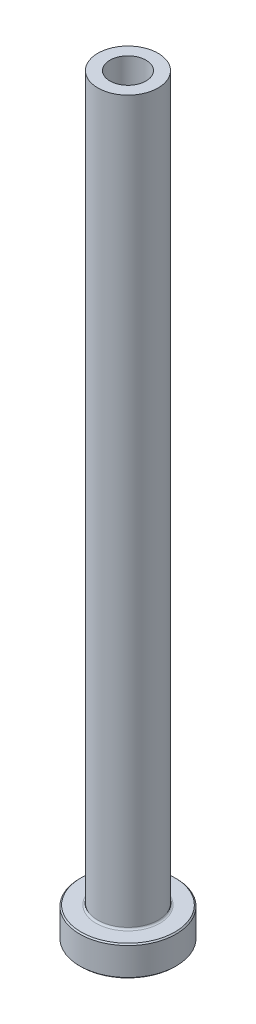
ISO-10303-21;
HEADER;
FILE_DESCRIPTION(('STEP AP214'),'2;1');
FILE_NAME('part.step','',(''),(''),'','','');
FILE_SCHEMA(('AUTOMOTIVE_DESIGN { 1 0 10303 214 1 1 1 1 }'));
ENDSEC;
DATA;
#1=APPLICATION_CONTEXT('core data for automotive mechanical design processes');
#2=APPLICATION_PROTOCOL_DEFINITION('international standard','automotive_design',2000,#1);
#3=PRODUCT_CONTEXT('',#1,'mechanical');
#4=PRODUCT('Part','Part','',(#3));
#5=PRODUCT_RELATED_PRODUCT_CATEGORY('part','',(#4));
#6=PRODUCT_DEFINITION_FORMATION('','',#4);
#7=PRODUCT_DEFINITION_CONTEXT('part definition',#1,'design');
#8=PRODUCT_DEFINITION('design','',#6,#7);
#9=PRODUCT_DEFINITION_SHAPE('','',#8);
#10=(LENGTH_UNIT() NAMED_UNIT(*) SI_UNIT(.MILLI.,.METRE.));
#11=(NAMED_UNIT(*) PLANE_ANGLE_UNIT() SI_UNIT($,.RADIAN.));
#12=(NAMED_UNIT(*) SI_UNIT($,.STERADIAN.) SOLID_ANGLE_UNIT());
#13=UNCERTAINTY_MEASURE_WITH_UNIT(LENGTH_MEASURE(1.E-05),#10,'distance_accuracy_value','');
#14=(GEOMETRIC_REPRESENTATION_CONTEXT(3) GLOBAL_UNCERTAINTY_ASSIGNED_CONTEXT((#13)) GLOBAL_UNIT_ASSIGNED_CONTEXT((#10,
#11,#12)) REPRESENTATION_CONTEXT('',''));
#15=CARTESIAN_POINT('',(0.,0.,0.));
#16=DIRECTION('',(0.,0.,1.));
#17=DIRECTION('',(1.,0.,0.));
#18=AXIS2_PLACEMENT_3D('',#15,#16,#17);
#19=CARTESIAN_POINT('',(0.,92.1876809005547,0.));
#20=DIRECTION('',(0.,1.,0.));
#21=DIRECTION('',(0.,0.,1.));
#22=AXIS2_PLACEMENT_3D('',#19,#20,#21);
#23=CYLINDRICAL_SURFACE('',#22,3.);
#24=CARTESIAN_POINT('',(0.,125.,0.));
#25=DIRECTION('',(0.,1.,0.));
#26=DIRECTION('',(0.,0.,1.));
#27=AXIS2_PLACEMENT_3D('',#24,#25,#26);
#28=CIRCLE('',#27,3.);
#29=CARTESIAN_POINT('',(0.,125.,3.));
#30=VERTEX_POINT('',#29);
#31=EDGE_CURVE('E62',#30,#30,#28,.T.);
#32=ORIENTED_EDGE('',*,*,#31,.T.);
#33=EDGE_LOOP('',(#32));
#34=FACE_BOUND('',#33,.T.);
#35=CARTESIAN_POINT('',(0.,80.,0.));
#36=DIRECTION('',(0.,1.,0.));
#37=DIRECTION('',(0.,0.,1.));
#38=AXIS2_PLACEMENT_3D('',#35,#36,#37);
#39=CIRCLE('',#38,3.);
#40=CARTESIAN_POINT('',(0.,80.,3.));
#41=VERTEX_POINT('',#40);
#42=EDGE_CURVE('E71',#41,#41,#39,.T.);
#43=ORIENTED_EDGE('',*,*,#42,.F.);
#44=EDGE_LOOP('',(#43));
#45=FACE_BOUND('',#44,.T.);
#46=ADVANCED_FACE('F30',(#34,#45),#23,.F.);
#47=CARTESIAN_POINT('',(-3.,125.,0.));
#48=DIRECTION('',(0.,1.,0.));
#49=DIRECTION('',(0.,0.,1.));
#50=AXIS2_PLACEMENT_3D('',#47,#48,#49);
#51=PLANE('',#50);
#52=CARTESIAN_POINT('',(0.,125.,0.));
#53=DIRECTION('',(0.,1.,0.));
#54=DIRECTION('',(0.,0.,1.));
#55=AXIS2_PLACEMENT_3D('',#52,#53,#54);
#56=CIRCLE('',#55,5.);
#57=CARTESIAN_POINT('',(0.,125.,5.));
#58=VERTEX_POINT('',#57);
#59=EDGE_CURVE('E65',#58,#58,#56,.T.);
#60=ORIENTED_EDGE('',*,*,#59,.T.);
#61=EDGE_LOOP('',(#60));
#62=FACE_BOUND('',#61,.T.);
#63=ORIENTED_EDGE('',*,*,#31,.F.);
#64=EDGE_LOOP('',(#63));
#65=FACE_BOUND('',#64,.T.);
#66=ADVANCED_FACE('F79',(#62,#65),#51,.T.);
#67=CARTESIAN_POINT('',(0.,92.1876809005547,0.));
#68=DIRECTION('',(0.,1.,0.));
#69=DIRECTION('',(0.,0.,1.));
#70=AXIS2_PLACEMENT_3D('',#67,#68,#69);
#71=CYLINDRICAL_SURFACE('',#70,5.);
#72=CARTESIAN_POINT('',(0.,5.3,0.));
#73=DIRECTION('',(0.,1.,0.));
#74=DIRECTION('',(0.,0.,1.));
#75=AXIS2_PLACEMENT_3D('',#72,#73,#74);
#76=CIRCLE('',#75,5.);
#77=CARTESIAN_POINT('',(0.,5.3,5.));
#78=VERTEX_POINT('',#77);
#79=EDGE_CURVE('E59',#78,#78,#76,.T.);
#80=ORIENTED_EDGE('',*,*,#79,.T.);
#81=EDGE_LOOP('',(#80));
#82=FACE_BOUND('',#81,.T.);
#83=ORIENTED_EDGE('',*,*,#59,.F.);
#84=EDGE_LOOP('',(#83));
#85=FACE_BOUND('',#84,.T.);
#86=ADVANCED_FACE('F85',(#82,#85),#71,.T.);
#87=CARTESIAN_POINT('',(-4.99999999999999,5.,0.));
#88=DIRECTION('',(0.,1.,0.));
#89=DIRECTION('',(0.,0.,1.));
#90=AXIS2_PLACEMENT_3D('',#87,#88,#89);
#91=PLANE('',#90);
#92=CARTESIAN_POINT('',(0.,5.,0.));
#93=DIRECTION('',(0.,1.,0.));
#94=DIRECTION('',(0.,0.,1.));
#95=AXIS2_PLACEMENT_3D('',#92,#93,#94);
#96=CIRCLE('',#95,7.79999999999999);
#97=CARTESIAN_POINT('',(0.,5.,7.79999999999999));
#98=VERTEX_POINT('',#97);
#99=EDGE_CURVE('E53',#98,#98,#96,.T.);
#100=ORIENTED_EDGE('',*,*,#99,.T.);
#101=EDGE_LOOP('',(#100));
#102=FACE_BOUND('',#101,.T.);
#103=CARTESIAN_POINT('',(0.,5.,0.));
#104=DIRECTION('',(0.,1.,0.));
#105=DIRECTION('',(0.,0.,1.));
#106=AXIS2_PLACEMENT_3D('',#103,#104,#105);
#107=CIRCLE('',#106,5.3);
#108=CARTESIAN_POINT('',(0.,5.,5.3));
#109=VERTEX_POINT('',#108);
#110=EDGE_CURVE('E56',#109,#109,#107,.F.);
#111=ORIENTED_EDGE('',*,*,#110,.T.);
#112=EDGE_LOOP('',(#111));
#113=FACE_BOUND('',#112,.T.);
#114=ADVANCED_FACE('F111',(#102,#113),#91,.T.);
#115=CARTESIAN_POINT('',(0.,92.1876809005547,0.));
#116=DIRECTION('',(0.,1.,0.));
#117=DIRECTION('',(0.,0.,1.));
#118=AXIS2_PLACEMENT_3D('',#115,#116,#117);
#119=CYLINDRICAL_SURFACE('',#118,7.99999999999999);
#120=CARTESIAN_POINT('',(0.,4.8,0.));
#121=DIRECTION('',(0.,1.,0.));
#122=DIRECTION('',(0.,0.,1.));
#123=AXIS2_PLACEMENT_3D('',#120,#121,#122);
#124=CIRCLE('',#123,7.99999999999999);
#125=CARTESIAN_POINT('',(0.,4.8,7.99999999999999));
#126=VERTEX_POINT('',#125);
#127=EDGE_CURVE('E45',#126,#126,#124,.F.);
#128=ORIENTED_EDGE('',*,*,#127,.T.);
#129=EDGE_LOOP('',(#128));
#130=FACE_BOUND('',#129,.T.);
#131=CARTESIAN_POINT('',(0.,0.20000000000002,0.));
#132=DIRECTION('',(0.,-1.,0.));
#133=DIRECTION('',(0.,0.,-1.));
#134=AXIS2_PLACEMENT_3D('',#131,#132,#133);
#135=CIRCLE('',#134,7.99999999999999);
#136=CARTESIAN_POINT('',(0.,0.20000000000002,-7.99999999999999));
#137=VERTEX_POINT('',#136);
#138=EDGE_CURVE('E50',#137,#137,#135,.F.);
#139=ORIENTED_EDGE('',*,*,#138,.T.);
#140=EDGE_LOOP('',(#139));
#141=FACE_BOUND('',#140,.T.);
#142=ADVANCED_FACE('F108',(#130,#141),#119,.T.);
#143=CARTESIAN_POINT('',(-7.99999999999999,0.,0.));
#144=DIRECTION('',(0.,-1.,0.));
#145=DIRECTION('',(0.,0.,-1.));
#146=AXIS2_PLACEMENT_3D('',#143,#144,#145);
#147=PLANE('',#146);
#148=CARTESIAN_POINT('',(0.,0.,0.));
#149=DIRECTION('',(0.,-1.,0.));
#150=DIRECTION('',(0.,0.,-1.));
#151=AXIS2_PLACEMENT_3D('',#148,#149,#150);
#152=CIRCLE('',#151,3.74999999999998);
#153=CARTESIAN_POINT('',(0.,0.,-3.74999999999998));
#154=VERTEX_POINT('',#153);
#155=EDGE_CURVE('E37',#154,#154,#152,.F.);
#156=ORIENTED_EDGE('',*,*,#155,.T.);
#157=EDGE_LOOP('',(#156));
#158=FACE_BOUND('',#157,.T.);
#159=CARTESIAN_POINT('',(0.,0.,0.));
#160=DIRECTION('',(0.,-1.,0.));
#161=DIRECTION('',(0.,0.,-1.));
#162=AXIS2_PLACEMENT_3D('',#159,#160,#161);
#163=CIRCLE('',#162,7.79999999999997);
#164=CARTESIAN_POINT('',(0.,0.,-7.79999999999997));
#165=VERTEX_POINT('',#164);
#166=EDGE_CURVE('E41',#165,#165,#163,.T.);
#167=ORIENTED_EDGE('',*,*,#166,.T.);
#168=EDGE_LOOP('',(#167));
#169=FACE_BOUND('',#168,.T.);
#170=ADVANCED_FACE('F110',(#158,#169),#147,.T.);
#171=CARTESIAN_POINT('',(0.,92.1876809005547,0.));
#172=DIRECTION('',(0.,1.,0.));
#173=DIRECTION('',(0.,0.,1.));
#174=AXIS2_PLACEMENT_3D('',#171,#172,#173);
#175=CYLINDRICAL_SURFACE('',#174,3.24999999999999);
#176=CARTESIAN_POINT('',(0.,0.499999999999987,0.));
#177=DIRECTION('',(0.,-1.,0.));
#178=DIRECTION('',(0.,0.,-1.));
#179=AXIS2_PLACEMENT_3D('',#176,#177,#178);
#180=CIRCLE('',#179,3.24999999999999);
#181=CARTESIAN_POINT('',(0.,0.499999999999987,-3.24999999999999));
#182=VERTEX_POINT('',#181);
#183=EDGE_CURVE('E10',#182,#182,#180,.T.);
#184=ORIENTED_EDGE('',*,*,#183,.T.);
#185=EDGE_LOOP('',(#184));
#186=FACE_BOUND('',#185,.T.);
#187=CARTESIAN_POINT('',(0.,68.,0.));
#188=DIRECTION('',(0.,1.,0.));
#189=DIRECTION('',(0.,0.,1.));
#190=AXIS2_PLACEMENT_3D('',#187,#188,#189);
#191=CIRCLE('',#190,3.25);
#192=CARTESIAN_POINT('',(0.,68.,3.25));
#193=VERTEX_POINT('',#192);
#194=EDGE_CURVE('E68',#193,#193,#191,.T.);
#195=ORIENTED_EDGE('',*,*,#194,.T.);
#196=EDGE_LOOP('',(#195));
#197=FACE_BOUND('',#196,.T.);
#198=ADVANCED_FACE('F118',(#186,#197),#175,.F.);
#199=CARTESIAN_POINT('',(0.,68.,0.));
#200=DIRECTION('',(0.,-1.,0.));
#201=DIRECTION('',(0.,0.,-1.));
#202=AXIS2_PLACEMENT_3D('',#199,#200,#201);
#203=CONICAL_SURFACE('',#202,3.25,0.0208303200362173);
#204=ORIENTED_EDGE('',*,*,#42,.T.);
#205=EDGE_LOOP('',(#204));
#206=FACE_BOUND('',#205,.T.);
#207=ORIENTED_EDGE('',*,*,#194,.F.);
#208=EDGE_LOOP('',(#207));
#209=FACE_BOUND('',#208,.T.);
#210=ADVANCED_FACE('F75',(#206,#209),#203,.F.);
#211=CARTESIAN_POINT('',(0.,5.3,0.));
#212=DIRECTION('',(0.,1.,0.));
#213=DIRECTION('',(0.,0.,1.));
#214=AXIS2_PLACEMENT_3D('',#211,#212,#213);
#215=TOROIDAL_SURFACE('',#214,5.3,0.3);
#216=ORIENTED_EDGE('',*,*,#110,.F.);
#217=EDGE_LOOP('',(#216));
#218=FACE_BOUND('',#217,.T.);
#219=ORIENTED_EDGE('',*,*,#79,.F.);
#220=EDGE_LOOP('',(#219));
#221=FACE_BOUND('',#220,.T.);
#222=ADVANCED_FACE('F90',(#218,#221),#215,.F.);
#223=CARTESIAN_POINT('',(0.,5.,0.));
#224=DIRECTION('',(0.,-1.,0.));
#225=DIRECTION('',(0.,0.,-1.));
#226=AXIS2_PLACEMENT_3D('',#223,#224,#225);
#227=CONICAL_SURFACE('',#226,7.79999999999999,0.78539816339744);
#228=ORIENTED_EDGE('',*,*,#127,.F.);
#229=EDGE_LOOP('',(#228));
#230=FACE_BOUND('',#229,.T.);
#231=ORIENTED_EDGE('',*,*,#99,.F.);
#232=EDGE_LOOP('',(#231));
#233=FACE_BOUND('',#232,.T.);
#234=ADVANCED_FACE('F93',(#230,#233),#227,.T.);
#235=CARTESIAN_POINT('',(0.,0.20000000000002,0.));
#236=DIRECTION('',(0.,1.,0.));
#237=DIRECTION('',(0.,0.,1.));
#238=AXIS2_PLACEMENT_3D('',#235,#236,#237);
#239=CONICAL_SURFACE('',#238,7.99999999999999,0.78539816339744);
#240=ORIENTED_EDGE('',*,*,#166,.F.);
#241=EDGE_LOOP('',(#240));
#242=FACE_BOUND('',#241,.T.);
#243=ORIENTED_EDGE('',*,*,#138,.F.);
#244=EDGE_LOOP('',(#243));
#245=FACE_BOUND('',#244,.T.);
#246=ADVANCED_FACE('F96',(#242,#245),#239,.T.);
#247=CARTESIAN_POINT('',(0.,0.,0.));
#248=DIRECTION('',(0.,-1.,0.));
#249=DIRECTION('',(0.,0.,-1.));
#250=AXIS2_PLACEMENT_3D('',#247,#248,#249);
#251=CONICAL_SURFACE('',#250,3.74999999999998,0.785398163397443);
#252=ORIENTED_EDGE('',*,*,#183,.F.);
#253=EDGE_LOOP('',(#252));
#254=FACE_BOUND('',#253,.T.);
#255=ORIENTED_EDGE('',*,*,#155,.F.);
#256=EDGE_LOOP('',(#255));
#257=FACE_BOUND('',#256,.T.);
#258=ADVANCED_FACE('F32',(#254,#257),#251,.F.);
#259=CLOSED_SHELL('',(#46,#66,#86,#114,#142,#170,#198,#210,#222,#234,#246,#258));
#260=MANIFOLD_SOLID_BREP('B2',#259);
#261=ADVANCED_BREP_SHAPE_REPRESENTATION('',(#18,#260),#14);
#262=SHAPE_DEFINITION_REPRESENTATION(#9,#261);
ENDSEC;
END-ISO-10303-21;
